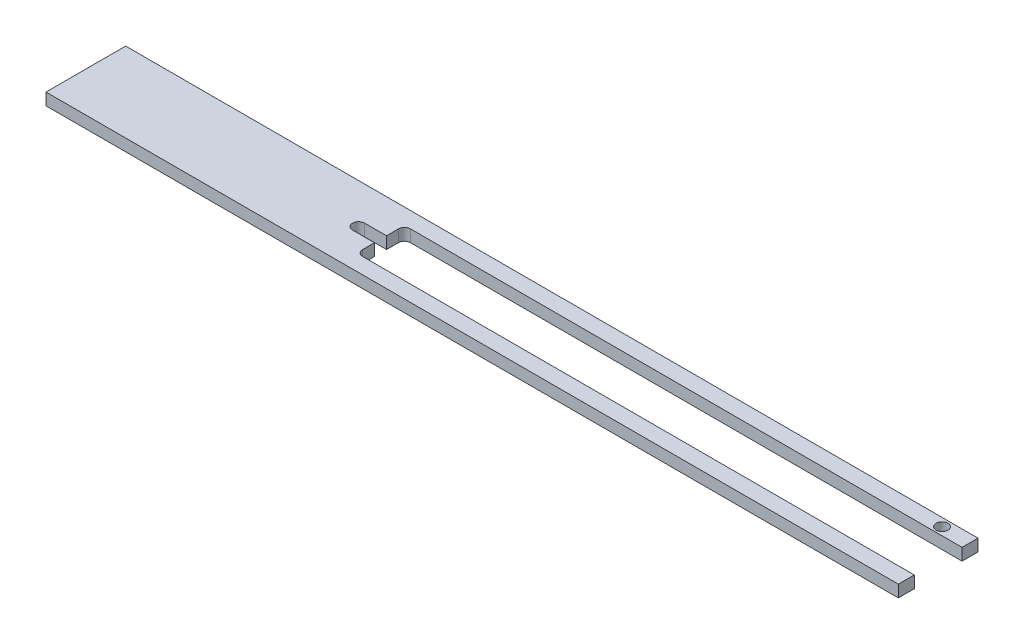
from build123d import *

# Parameters (mm, degrees)
SKETCH_1_R      = 0.75
EXTRUDE_1_DEPTH = 1.5


with BuildPart() as part:
    # Sketch 1 → Extrude 1 (new body)
    with BuildSketch(Plane(origin=(0, 0, 0), x_dir=(1, 0, 0), z_dir=(0, 1, 0))):
        with BuildLine():
            Line((55.457908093, 3.119606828), (-13.792091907, 3.119606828))
            ThreePointArc((-13.792091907, 3.119606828), (-14.322421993, 2.899936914), (-14.542091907, 2.369606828))
            Line((-14.542091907, 2.369606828), (-14.542091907, 0.869606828))
            Line((-14.542091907, 0.869606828), (-17.292091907, 0.869606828))
            ThreePointArc((-17.292091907, 0.869606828), (-18.049263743, 0.112434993), (-17.292091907, -0.644736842))
            Line((-17.292091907, -0.644736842), (-14.542091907, -0.644736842))
            Line((-14.542091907, -0.644736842), (-14.542091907, -2.130393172))
            ThreePointArc((-14.542091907, -2.130393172), (-14.322421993, -2.660723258), (-13.792091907, -2.880393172))
            Line((-13.792091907, -2.880393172), (55.457908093, -2.880393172))
            Line((55.457908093, -2.880393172), (55.457908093, -4.880393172))
            Line((55.457908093, -4.880393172), (-51.542091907, -4.880393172))
            Line((-51.542091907, -4.880393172), (-51.542091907, 5.119606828))
            Line((-51.542091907, 5.119606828), (55.457908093, 5.119606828))
            Line((55.457908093, 5.119606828), (55.457908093, 3.119606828))
        make_face()
        with Locations(Location((51.957908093, 4.105263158, 0), (0, 0, 270))):
            Circle(SKETCH_1_R, mode=Mode.SUBTRACT)
    extrude(amount=EXTRUDE_1_DEPTH)


solid = part.part
